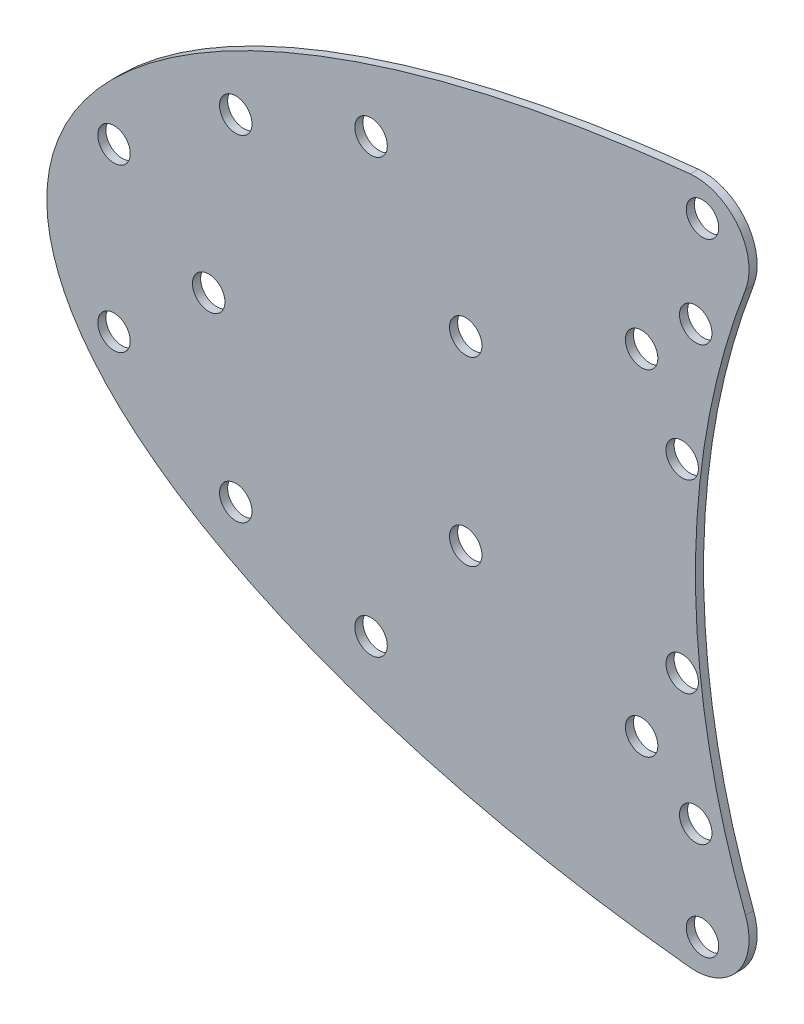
from build123d import *

# Parameters (mm, degrees)
ESQUISSE1_R        = 6
BOSS_EXTRU_1_DEPTH = 3


with BuildPart() as part:
    # Esquisse1 → Boss.-Extru.1 (new body)
    with BuildSketch(Plane(origin=(0, 0, 0), x_dir=(-1, 0, 0), z_dir=(0, 0, -1))):
        with BuildLine():
            ThreePointArc((41.607576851, 100.100488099), (60.104680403, 0), (41.607576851, -100.100488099))
            ThreePointArc((41.607576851, -100.100488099), (44.343472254, -119.241252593), (62.045483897, -127.018962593))
            add(Edge.make_bspline(
                [(62.045483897, -127.018962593), (299.835962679, -102.657074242), (299.835962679, -0.001241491), (299.835962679, 102.654591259), (62.045483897, 127.018962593)],
                knots=[1.810413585, 1.810413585, 1.810413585, 3.14159531, 3.14159531, 4.472777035, 4.472777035, 4.472777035], degree=2, weights=[1, 0.786552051, 1, 0.786552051, 1]))
            ThreePointArc((62.045483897, 127.018962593), (44.343472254, 119.241252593), (41.607576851, 100.100488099))
        make_face()
        with Locations(Location((275, -30, 0), (0, 0, 180))):
            Circle(ESQUISSE1_R, mode=Mode.SUBTRACT)
        with Locations(Location((275, 30, 0), (0, 0, 180))):
            Circle(ESQUISSE1_R, mode=Mode.SUBTRACT)
        with Locations(Location((240, 0, 0), (0, 0, 180))):
            Circle(ESQUISSE1_R, mode=Mode.SUBTRACT)
        with Locations(Location((230, 62, 0), (0, 0, 180))):
            Circle(ESQUISSE1_R, mode=Mode.SUBTRACT)
        with Locations(Location((230, -62, 0), (0, 0, 180))):
            Circle(ESQUISSE1_R, mode=Mode.SUBTRACT)
        with Locations(Location((180, 80, 0), (0, 0, 180))):
            Circle(ESQUISSE1_R, mode=Mode.SUBTRACT)
        with Locations(Location((180, -80, 0), (0, 0, 180))):
            Circle(ESQUISSE1_R, mode=Mode.SUBTRACT)
        with Locations(Location((145, -33.5, 0), (0, 0, 180))):
            Circle(ESQUISSE1_R, mode=Mode.SUBTRACT)
        with Locations(Location((65, 34.2, 0), (0, 0, 180))):
            Circle(ESQUISSE1_R, mode=Mode.SUBTRACT)
        with Locations(Location((145, 33.5, 0), (0, 0, 180))):
            Circle(ESQUISSE1_R, mode=Mode.SUBTRACT)
        with Locations(Location((65, -34.2, 0), (0, 0, 180))):
            Circle(ESQUISSE1_R, mode=Mode.SUBTRACT)
        with Locations(Location((80, 62, 0), (0, 0, 180))):
            Circle(ESQUISSE1_R, mode=Mode.SUBTRACT)
        with Locations(Location((60, 80, 0), (0, 0, 180))):
            Circle(ESQUISSE1_R, mode=Mode.SUBTRACT)
        with Locations(Location((60, -80, 0), (0, 0, 180))):
            Circle(ESQUISSE1_R, mode=Mode.SUBTRACT)
        with Locations(Location((80, -62, 0), (0, 0, 180))):
            Circle(ESQUISSE1_R, mode=Mode.SUBTRACT)
        with Locations(Location((57.5, -115, 0), (0, 0, 180))):
            Circle(ESQUISSE1_R, mode=Mode.SUBTRACT)
        with Locations(Location((57.5, 115, 0), (0, 0, 180))):
            Circle(ESQUISSE1_R, mode=Mode.SUBTRACT)
    extrude(amount=-BOSS_EXTRU_1_DEPTH)


solid = part.part
